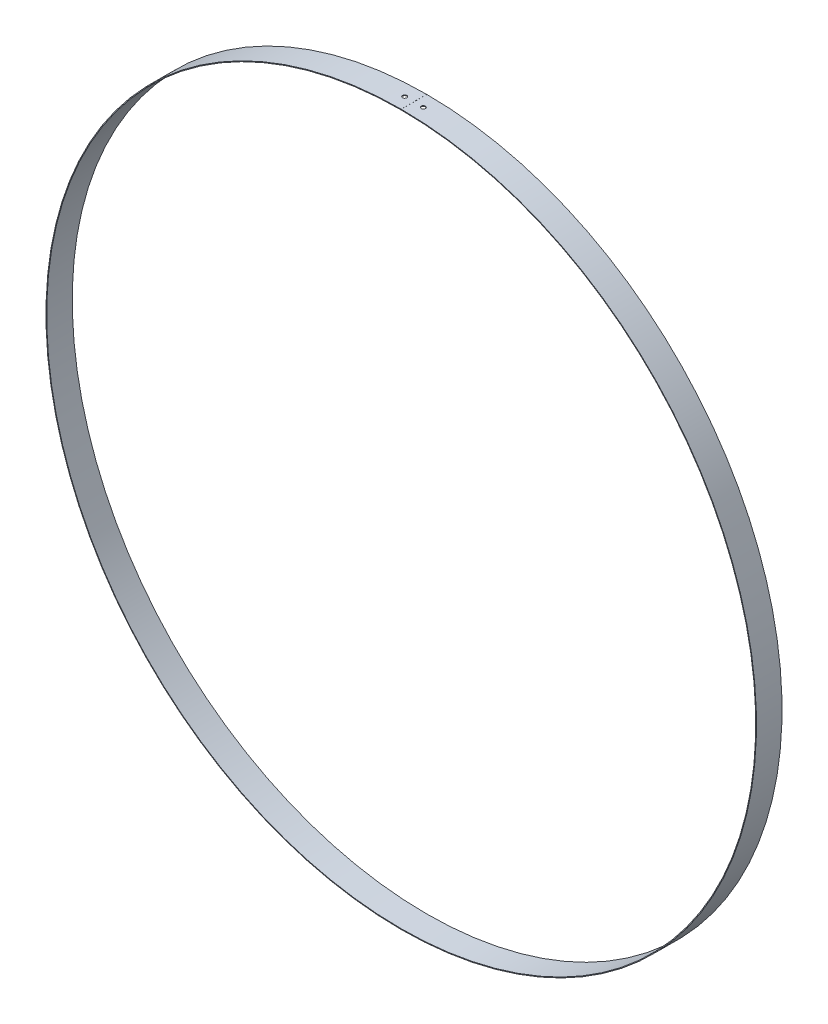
ISO-10303-21;
HEADER;
FILE_DESCRIPTION(('STEP AP214'),'2;1');
FILE_NAME('part.step','',(''),(''),'','','');
FILE_SCHEMA(('AUTOMOTIVE_DESIGN { 1 0 10303 214 1 1 1 1 }'));
ENDSEC;
DATA;
#1=APPLICATION_CONTEXT('core data for automotive mechanical design processes');
#2=APPLICATION_PROTOCOL_DEFINITION('international standard','automotive_design',2000,#1);
#3=PRODUCT_CONTEXT('',#1,'mechanical');
#4=PRODUCT('Part','Part','',(#3));
#5=PRODUCT_RELATED_PRODUCT_CATEGORY('part','',(#4));
#6=PRODUCT_DEFINITION_FORMATION('','',#4);
#7=PRODUCT_DEFINITION_CONTEXT('part definition',#1,'design');
#8=PRODUCT_DEFINITION('design','',#6,#7);
#9=PRODUCT_DEFINITION_SHAPE('','',#8);
#10=(LENGTH_UNIT() NAMED_UNIT(*) SI_UNIT(.MILLI.,.METRE.));
#11=(NAMED_UNIT(*) PLANE_ANGLE_UNIT() SI_UNIT($,.RADIAN.));
#12=(NAMED_UNIT(*) SI_UNIT($,.STERADIAN.) SOLID_ANGLE_UNIT());
#13=UNCERTAINTY_MEASURE_WITH_UNIT(LENGTH_MEASURE(1.E-05),#10,'distance_accuracy_value','');
#14=(GEOMETRIC_REPRESENTATION_CONTEXT(3) GLOBAL_UNCERTAINTY_ASSIGNED_CONTEXT((#13)) GLOBAL_UNIT_ASSIGNED_CONTEXT((#10,
#11,#12)) REPRESENTATION_CONTEXT('',''));
#15=CARTESIAN_POINT('',(0.,0.,0.));
#16=DIRECTION('',(0.,0.,1.));
#17=DIRECTION('',(1.,0.,0.));
#18=AXIS2_PLACEMENT_3D('',#15,#16,#17);
#19=CARTESIAN_POINT('',(0.0250250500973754,249.74999874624,8.99999999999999));
#20=DIRECTION('',(-0.99999999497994,0.000100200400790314,0.));
#21=DIRECTION('',(0.,0.,1.));
#22=AXIS2_PLACEMENT_3D('',#19,#20,#21);
#23=PLANE('',#22);
#24=DIRECTION('',(0.000100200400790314,0.99999999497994,0.));
#25=VECTOR('',#24,1.);
#26=CARTESIAN_POINT('',(0.0250250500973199,249.74999874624,0.));
#27=LINE('',#26,#25);
#28=CARTESIAN_POINT('',(0.0249999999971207,249.499998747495,0.));
#29=VERTEX_POINT('',#28);
#30=CARTESIAN_POINT('',(0.0250501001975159,249.999998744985,0.));
#31=VERTEX_POINT('',#30);
#32=EDGE_CURVE('E14',#29,#31,#27,.T.);
#33=ORIENTED_EDGE('',*,*,#32,.F.);
#34=DIRECTION('',(0.,0.,-1.));
#35=VECTOR('',#34,1.);
#36=CARTESIAN_POINT('',(0.0250000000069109,249.499998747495,1587.27889575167));
#37=LINE('',#36,#35);
#38=CARTESIAN_POINT('',(0.0249999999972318,249.499998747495,18.));
#39=VERTEX_POINT('',#38);
#40=EDGE_CURVE('E115',#29,#39,#37,.F.);
#41=ORIENTED_EDGE('',*,*,#40,.T.);
#42=DIRECTION('',(0.000100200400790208,0.99999999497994,0.));
#43=VECTOR('',#42,1.);
#44=CARTESIAN_POINT('',(0.0250250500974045,249.74999874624,18.));
#45=LINE('',#44,#43);
#46=CARTESIAN_POINT('',(0.0250501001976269,249.999998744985,18.));
#47=VERTEX_POINT('',#46);
#48=EDGE_CURVE('E66',#39,#47,#45,.T.);
#49=ORIENTED_EDGE('',*,*,#48,.T.);
#50=DIRECTION('',(0.,0.,-1.));
#51=VECTOR('',#50,1.);
#52=CARTESIAN_POINT('',(0.0250501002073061,249.999998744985,1587.27889575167));
#53=LINE('',#52,#51);
#54=EDGE_CURVE('E179',#31,#47,#53,.F.);
#55=ORIENTED_EDGE('',*,*,#54,.F.);
#56=EDGE_LOOP('',(#33,#41,#49,#55));
#57=FACE_BOUND('',#56,.T.);
#58=ADVANCED_FACE('F53',(#57),#23,.T.);
#59=CARTESIAN_POINT('',(0.,0.,18.));
#60=DIRECTION('',(0.,0.,-1.));
#61=DIRECTION('',(-1.,0.,0.));
#62=AXIS2_PLACEMENT_3D('',#59,#60,#61);
#63=PLANE('',#62);
#64=ORIENTED_EDGE('',*,*,#48,.F.);
#65=CARTESIAN_POINT('',(0.,0.,18.));
#66=DIRECTION('',(0.,0.,-1.));
#67=DIRECTION('',(-1.,0.,0.));
#68=AXIS2_PLACEMENT_3D('',#65,#66,#67);
#69=CIRCLE('',#68,249.5);
#70=CARTESIAN_POINT('',(-0.0249999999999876,249.499998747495,18.));
#71=VERTEX_POINT('',#70);
#72=EDGE_CURVE('E110',#71,#39,#69,.F.);
#73=ORIENTED_EDGE('',*,*,#72,.F.);
#74=DIRECTION('',(-0.000100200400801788,0.99999999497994,0.));
#75=VECTOR('',#74,1.);
#76=CARTESIAN_POINT('',(-0.0250250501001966,249.74999874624,18.));
#77=LINE('',#76,#75);
#78=CARTESIAN_POINT('',(-0.0250501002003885,249.999998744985,18.));
#79=VERTEX_POINT('',#78);
#80=EDGE_CURVE('E92',#71,#79,#77,.T.);
#81=ORIENTED_EDGE('',*,*,#80,.T.);
#82=CARTESIAN_POINT('',(0.,0.,18.));
#83=DIRECTION('',(0.,0.,-1.));
#84=DIRECTION('',(-1.,0.,0.));
#85=AXIS2_PLACEMENT_3D('',#82,#83,#84);
#86=CIRCLE('',#85,250.);
#87=EDGE_CURVE('E183',#79,#47,#86,.F.);
#88=ORIENTED_EDGE('',*,*,#87,.T.);
#89=EDGE_LOOP('',(#64,#73,#81,#88));
#90=FACE_BOUND('',#89,.T.);
#91=ADVANCED_FACE('F114',(#90),#63,.F.);
#92=CARTESIAN_POINT('',(-0.0250250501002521,249.74999874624,8.99999999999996));
#93=DIRECTION('',(0.99999999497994,0.000100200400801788,0.));
#94=DIRECTION('',(0.,0.,-1.));
#95=AXIS2_PLACEMENT_3D('',#92,#93,#94);
#96=PLANE('',#95);
#97=ORIENTED_EDGE('',*,*,#80,.F.);
#98=DIRECTION('',(0.,0.,-1.));
#99=VECTOR('',#98,1.);
#100=CARTESIAN_POINT('',(-0.0249999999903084,249.499998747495,1587.27889575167));
#101=LINE('',#100,#99);
#102=CARTESIAN_POINT('',(-0.0250000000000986,249.499998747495,0.));
#103=VERTEX_POINT('',#102);
#104=EDGE_CURVE('E96',#71,#103,#101,.T.);
#105=ORIENTED_EDGE('',*,*,#104,.T.);
#106=DIRECTION('',(-0.000100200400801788,0.99999999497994,0.));
#107=VECTOR('',#106,1.);
#108=CARTESIAN_POINT('',(-0.0250250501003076,249.74999874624,0.));
#109=LINE('',#108,#107);
#110=CARTESIAN_POINT('',(-0.0250501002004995,249.999998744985,0.));
#111=VERTEX_POINT('',#110);
#112=EDGE_CURVE('E60',#103,#111,#109,.T.);
#113=ORIENTED_EDGE('',*,*,#112,.T.);
#114=DIRECTION('',(0.,0.,-1.));
#115=VECTOR('',#114,1.);
#116=CARTESIAN_POINT('',(-0.0250501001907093,249.999998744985,1587.27889575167));
#117=LINE('',#116,#115);
#118=EDGE_CURVE('E99',#79,#111,#117,.T.);
#119=ORIENTED_EDGE('',*,*,#118,.F.);
#120=EDGE_LOOP('',(#97,#105,#113,#119));
#121=FACE_BOUND('',#120,.T.);
#122=ADVANCED_FACE('F94',(#121),#96,.T.);
#123=CARTESIAN_POINT('',(0.,0.,0.));
#124=DIRECTION('',(0.,0.,-1.));
#125=DIRECTION('',(-1.,0.,0.));
#126=AXIS2_PLACEMENT_3D('',#123,#124,#125);
#127=PLANE('',#126);
#128=CARTESIAN_POINT('',(0.,0.,0.));
#129=DIRECTION('',(0.,0.,-1.));
#130=DIRECTION('',(-1.,0.,0.));
#131=AXIS2_PLACEMENT_3D('',#128,#129,#130);
#132=CIRCLE('',#131,249.5);
#133=EDGE_CURVE('E112',#103,#29,#132,.F.);
#134=ORIENTED_EDGE('',*,*,#133,.T.);
#135=ORIENTED_EDGE('',*,*,#32,.T.);
#136=CARTESIAN_POINT('',(0.,0.,0.));
#137=DIRECTION('',(0.,0.,-1.));
#138=DIRECTION('',(-1.,0.,0.));
#139=AXIS2_PLACEMENT_3D('',#136,#137,#138);
#140=CIRCLE('',#139,250.);
#141=EDGE_CURVE('E184',#111,#31,#140,.F.);
#142=ORIENTED_EDGE('',*,*,#141,.F.);
#143=ORIENTED_EDGE('',*,*,#112,.F.);
#144=EDGE_LOOP('',(#134,#135,#142,#143));
#145=FACE_BOUND('',#144,.T.);
#146=ADVANCED_FACE('F136',(#145),#127,.T.);
#147=CARTESIAN_POINT('',(-8.04660977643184,249.870470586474,8.99999999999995));
#148=CARTESIAN_POINT('',(-8.0465376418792,249.870472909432,9.19907453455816));
#149=CARTESIAN_POINT('',(-8.00834239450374,249.871711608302,9.3906042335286));
#150=CARTESIAN_POINT('',(-7.85597282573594,249.876548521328,9.75792189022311));
#151=CARTESIAN_POINT('',(-7.74710979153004,249.879975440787,9.92039859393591));
#152=CARTESIAN_POINT('',(-7.46555661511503,249.888545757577,10.2014533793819));
#153=CARTESIAN_POINT('',(-7.30286583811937,249.893381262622,10.3098806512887));
#154=CARTESIAN_POINT('',(-6.93505681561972,249.903859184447,10.461952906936));
#155=CARTESIAN_POINT('',(-6.74329406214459,249.909118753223,10.4999806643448));
#156=CARTESIAN_POINT('',(-6.34518025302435,249.919543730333,10.5000193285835));
#157=CARTESIAN_POINT('',(-6.15346946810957,249.92432590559,10.4619404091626));
#158=CARTESIAN_POINT('',(-5.78552083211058,249.933114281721,10.3099071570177));
#159=CARTESIAN_POINT('',(-5.62288696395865,249.936797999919,10.2014329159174));
#160=CARTESIAN_POINT('',(-5.34115861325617,249.942977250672,9.92041914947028));
#161=CARTESIAN_POINT('',(-5.23237619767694,249.945250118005,9.75784801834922));
#162=CARTESIAN_POINT('',(-5.07986716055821,249.948396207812,9.39071187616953));
#163=CARTESIAN_POINT('',(-5.04170197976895,249.949157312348,9.19872485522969));
#164=CARTESIAN_POINT('',(-5.04155369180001,249.949160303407,8.80127515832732));
#165=CARTESIAN_POINT('',(-5.07990397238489,249.94839544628,8.60940191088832));
#166=CARTESIAN_POINT('',(-5.23232532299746,249.945251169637,8.24207201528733));
#167=CARTESIAN_POINT('',(-5.34120843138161,249.942976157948,8.0796053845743));
#168=CARTESIAN_POINT('',(-5.62283698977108,249.936799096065,7.79854273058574));
#169=CARTESIAN_POINT('',(-5.78554931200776,249.933113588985,7.69011898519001));
#170=CARTESIAN_POINT('',(-6.15340704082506,249.924327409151,7.5380474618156));
#171=CARTESIAN_POINT('',(-6.34518461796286,249.919543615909,7.50001970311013));
#172=CARTESIAN_POINT('',(-6.74328938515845,249.909118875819,7.499980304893));
#173=CARTESIAN_POINT('',(-6.93499697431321,249.903860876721,7.5380630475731));
#174=CARTESIAN_POINT('',(-7.30289188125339,249.89338053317,7.69008940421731));
#175=CARTESIAN_POINT('',(-7.46550057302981,249.888547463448,7.79856855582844));
#176=CARTESIAN_POINT('',(-7.74716576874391,249.879973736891,8.07957940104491));
#177=CARTESIAN_POINT('',(-7.85577186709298,249.876554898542,8.24179850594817));
#178=CARTESIAN_POINT('',(-8.00852936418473,249.871705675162,8.60964155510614));
#179=CARTESIAN_POINT('',(-8.04668191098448,249.870468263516,8.80092546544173));
#180=CARTESIAN_POINT('',(-8.04660977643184,249.870470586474,8.99999999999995));
#181=CARTESIAN_POINT('',(-8.03051655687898,249.370729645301,8.99999999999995));
#182=CARTESIAN_POINT('',(-8.03044456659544,249.370731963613,9.19907453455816));
#183=CARTESIAN_POINT('',(-7.99232570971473,249.371968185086,9.3906042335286));
#184=CARTESIAN_POINT('',(-7.84026088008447,249.376795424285,9.75792189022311));
#185=CARTESIAN_POINT('',(-7.73161557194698,249.380215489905,9.92039859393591));
#186=CARTESIAN_POINT('',(-7.4506255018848,249.388768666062,10.2014533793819));
#187=CARTESIAN_POINT('',(-7.28826010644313,249.393594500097,10.3098806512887));
#188=CARTESIAN_POINT('',(-6.92118670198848,249.404051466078,10.461952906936));
#189=CARTESIAN_POINT('',(-6.7298074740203,249.409300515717,10.4999806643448));
#190=CARTESIAN_POINT('',(-6.33248989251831,249.419704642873,10.5000193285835));
#191=CARTESIAN_POINT('',(-6.14116252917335,249.424477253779,10.4619404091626));
#192=CARTESIAN_POINT('',(-5.77394979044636,249.433248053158,10.3099071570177));
#193=CARTESIAN_POINT('',(-5.61164119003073,249.436924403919,10.2014329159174));
#194=CARTESIAN_POINT('',(-5.33047629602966,249.44309129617,9.92041914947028));
#195=CARTESIAN_POINT('',(-5.22191144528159,249.445359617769,9.75784801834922));
#196=CARTESIAN_POINT('',(-5.06970742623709,249.448499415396,9.39071187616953));
#197=CARTESIAN_POINT('',(-5.03161857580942,249.449258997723,9.19872485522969));
#198=CARTESIAN_POINT('',(-5.03147058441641,249.4492619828,8.80127515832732));
#199=CARTESIAN_POINT('',(-5.06974416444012,249.448498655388,8.60940191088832));
#200=CARTESIAN_POINT('',(-5.22186067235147,249.445360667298,8.24207201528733));
#201=CARTESIAN_POINT('',(-5.33052601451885,249.443090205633,8.0796053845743));
#202=CARTESIAN_POINT('',(-5.61159131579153,249.436925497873,7.79854273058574));
#203=CARTESIAN_POINT('',(-5.77397821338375,249.433247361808,7.69011898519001));
#204=CARTESIAN_POINT('',(-6.14110022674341,249.424478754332,7.5380474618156));
#205=CARTESIAN_POINT('',(-6.33249424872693,249.419704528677,7.50001970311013));
#206=CARTESIAN_POINT('',(-6.72980280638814,249.409300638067,7.499980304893));
#207=CARTESIAN_POINT('',(-6.92112698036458,249.404053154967,7.5380630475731));
#208=CARTESIAN_POINT('',(-7.28828609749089,249.393593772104,7.69008940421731));
#209=CARTESIAN_POINT('',(-7.45056957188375,249.388770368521,7.79856855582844));
#210=CARTESIAN_POINT('',(-7.73167143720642,249.380213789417,8.07957940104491));
#211=CARTESIAN_POINT('',(-7.8400603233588,249.376801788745,8.24179850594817));
#212=CARTESIAN_POINT('',(-7.99251230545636,249.371962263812,8.60964155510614));
#213=CARTESIAN_POINT('',(-8.03058854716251,249.370727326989,8.80092546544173));
#214=CARTESIAN_POINT('',(-8.03051655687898,249.370729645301,8.99999999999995));
#215=B_SPLINE_SURFACE_WITH_KNOTS('',1,3,((#147,#148,#149,#150,#151,#152,#153,#154,#155,#156,
#157,#158,#159,#160,#161,#162,#163,#164,#165,#166,#167,#168,#169,#170,#171,#172,#173,#174,#175,
#176,#177,#178,#179,#180),(#181,#182,#183,#184,#185,#186,#187,#188,#189,#190,#191,#192,#193,
#194,#195,#196,#197,#198,#199,#200,#201,#202,#203,#204,#205,#206,#207,#208,#209,#210,#211,#212,
#213,#214)),.UNSPECIFIED.,.F.,.T.,.F.,(2,2),(4,2,2,2,2,2,2,2,2,2,2,2,2,2,2,2,4),(0.,1.),(0.,
0.0625,0.125,0.1875,0.25,0.3125,0.375,0.4375,0.5,0.5625,0.625,0.6875,0.75,0.8125,0.875,0.9375,
1.),.UNSPECIFIED.);
#216=CARTESIAN_POINT('',(-8.04660977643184,249.870470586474,8.99999999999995));
#217=CARTESIAN_POINT('',(-8.0465376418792,249.870472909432,9.19907453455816));
#218=CARTESIAN_POINT('',(-8.00834239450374,249.871711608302,9.3906042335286));
#219=CARTESIAN_POINT('',(-7.85597282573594,249.876548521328,9.75792189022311));
#220=CARTESIAN_POINT('',(-7.74710979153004,249.879975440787,9.92039859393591));
#221=CARTESIAN_POINT('',(-7.46555661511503,249.888545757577,10.2014533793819));
#222=CARTESIAN_POINT('',(-7.30286583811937,249.893381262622,10.3098806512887));
#223=CARTESIAN_POINT('',(-6.93505681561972,249.903859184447,10.461952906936));
#224=CARTESIAN_POINT('',(-6.74329406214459,249.909118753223,10.4999806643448));
#225=CARTESIAN_POINT('',(-6.34518025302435,249.919543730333,10.5000193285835));
#226=CARTESIAN_POINT('',(-6.15346946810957,249.92432590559,10.4619404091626));
#227=CARTESIAN_POINT('',(-5.78552083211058,249.933114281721,10.3099071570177));
#228=CARTESIAN_POINT('',(-5.62288696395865,249.936797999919,10.2014329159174));
#229=CARTESIAN_POINT('',(-5.34115861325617,249.942977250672,9.92041914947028));
#230=CARTESIAN_POINT('',(-5.23237619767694,249.945250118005,9.75784801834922));
#231=CARTESIAN_POINT('',(-5.07986716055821,249.948396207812,9.39071187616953));
#232=CARTESIAN_POINT('',(-5.04170197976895,249.949157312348,9.19872485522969));
#233=CARTESIAN_POINT('',(-5.04155369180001,249.949160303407,8.80127515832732));
#234=CARTESIAN_POINT('',(-5.07990397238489,249.94839544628,8.60940191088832));
#235=CARTESIAN_POINT('',(-5.23232532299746,249.945251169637,8.24207201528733));
#236=CARTESIAN_POINT('',(-5.34120843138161,249.942976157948,8.0796053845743));
#237=CARTESIAN_POINT('',(-5.62283698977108,249.936799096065,7.79854273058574));
#238=CARTESIAN_POINT('',(-5.78554931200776,249.933113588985,7.69011898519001));
#239=CARTESIAN_POINT('',(-6.15340704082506,249.924327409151,7.5380474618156));
#240=CARTESIAN_POINT('',(-6.34518461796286,249.919543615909,7.50001970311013));
#241=CARTESIAN_POINT('',(-6.74328938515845,249.909118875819,7.499980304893));
#242=CARTESIAN_POINT('',(-6.93499697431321,249.903860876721,7.5380630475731));
#243=CARTESIAN_POINT('',(-7.30289188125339,249.89338053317,7.69008940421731));
#244=CARTESIAN_POINT('',(-7.46550057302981,249.888547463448,7.79856855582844));
#245=CARTESIAN_POINT('',(-7.74716576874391,249.879973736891,8.07957940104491));
#246=CARTESIAN_POINT('',(-7.85577186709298,249.876554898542,8.24179850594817));
#247=CARTESIAN_POINT('',(-8.00852936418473,249.871705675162,8.60964155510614));
#248=CARTESIAN_POINT('',(-8.04668191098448,249.870468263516,8.80092546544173));
#249=CARTESIAN_POINT('',(-8.04660977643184,249.870470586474,8.99999999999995));
#250=B_SPLINE_CURVE_WITH_KNOTS('',3,(#216,#217,#218,#219,#220,#221,#222,#223,#224,#225,#226,
#227,#228,#229,#230,#231,#232,#233,#234,#235,#236,#237,#238,#239,#240,#241,#242,#243,#244,#245,
#246,#247,#248,#249),.UNSPECIFIED.,.T.,.F.,(4,2,2,2,2,2,2,2,2,2,2,2,2,2,2,2,4),(0.,0.0625,0.125,
0.1875,0.25,0.3125,0.375,0.4375,0.5,0.5625,0.625,0.6875,0.75,0.8125,0.875,0.9375,1.),.UNSPECIFIED.);
#251=CARTESIAN_POINT('',(-8.04660977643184,249.870470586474,8.99999999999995));
#252=VERTEX_POINT('',#251);
#253=EDGE_CURVE('E188',#252,#252,#250,.T.);
#254=CARTESIAN_POINT('',(-8.03051655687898,249.370729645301,8.99999999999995));
#255=CARTESIAN_POINT('',(-8.03058854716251,249.370727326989,8.80092546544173));
#256=CARTESIAN_POINT('',(-7.99251230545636,249.371962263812,8.60964155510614));
#257=CARTESIAN_POINT('',(-7.8400603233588,249.376801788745,8.24179850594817));
#258=CARTESIAN_POINT('',(-7.73167143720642,249.380213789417,8.07957940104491));
#259=CARTESIAN_POINT('',(-7.45056957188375,249.388770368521,7.79856855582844));
#260=CARTESIAN_POINT('',(-7.28828609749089,249.393593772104,7.69008940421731));
#261=CARTESIAN_POINT('',(-6.92112698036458,249.404053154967,7.5380630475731));
#262=CARTESIAN_POINT('',(-6.72980280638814,249.409300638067,7.499980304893));
#263=CARTESIAN_POINT('',(-6.33249424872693,249.419704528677,7.50001970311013));
#264=CARTESIAN_POINT('',(-6.14110022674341,249.424478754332,7.5380474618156));
#265=CARTESIAN_POINT('',(-5.77397821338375,249.433247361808,7.69011898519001));
#266=CARTESIAN_POINT('',(-5.61159131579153,249.436925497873,7.79854273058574));
#267=CARTESIAN_POINT('',(-5.33052601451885,249.443090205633,8.0796053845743));
#268=CARTESIAN_POINT('',(-5.22186067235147,249.445360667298,8.24207201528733));
#269=CARTESIAN_POINT('',(-5.06974416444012,249.448498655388,8.60940191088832));
#270=CARTESIAN_POINT('',(-5.03147058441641,249.4492619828,8.80127515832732));
#271=CARTESIAN_POINT('',(-5.03161857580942,249.449258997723,9.19872485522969));
#272=CARTESIAN_POINT('',(-5.06970742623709,249.448499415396,9.39071187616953));
#273=CARTESIAN_POINT('',(-5.22191144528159,249.445359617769,9.75784801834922));
#274=CARTESIAN_POINT('',(-5.33047629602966,249.44309129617,9.92041914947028));
#275=CARTESIAN_POINT('',(-5.61164119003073,249.436924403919,10.2014329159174));
#276=CARTESIAN_POINT('',(-5.77394979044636,249.433248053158,10.3099071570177));
#277=CARTESIAN_POINT('',(-6.14116252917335,249.424477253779,10.4619404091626));
#278=CARTESIAN_POINT('',(-6.33248989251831,249.419704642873,10.5000193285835));
#279=CARTESIAN_POINT('',(-6.7298074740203,249.409300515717,10.4999806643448));
#280=CARTESIAN_POINT('',(-6.92118670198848,249.404051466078,10.461952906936));
#281=CARTESIAN_POINT('',(-7.28826010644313,249.393594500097,10.3098806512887));
#282=CARTESIAN_POINT('',(-7.4506255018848,249.388768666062,10.2014533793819));
#283=CARTESIAN_POINT('',(-7.73161557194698,249.380215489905,9.92039859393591));
#284=CARTESIAN_POINT('',(-7.84026088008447,249.376795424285,9.75792189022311));
#285=CARTESIAN_POINT('',(-7.99232570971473,249.371968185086,9.3906042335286));
#286=CARTESIAN_POINT('',(-8.03044456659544,249.370731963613,9.19907453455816));
#287=CARTESIAN_POINT('',(-8.03051655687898,249.370729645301,8.99999999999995));
#288=B_SPLINE_CURVE_WITH_KNOTS('',3,(#254,#255,#256,#257,#258,#259,#260,#261,#262,#263,#264,
#265,#266,#267,#268,#269,#270,#271,#272,#273,#274,#275,#276,#277,#278,#279,#280,#281,#282,#283,
#284,#285,#286,#287),.UNSPECIFIED.,.T.,.F.,(4,2,2,2,2,2,2,2,2,2,2,2,2,2,2,2,4),(0.,0.0625,0.125,
0.1875,0.25,0.3125,0.375,0.4375,0.5,0.5625,0.625,0.6875,0.75,0.8125,0.875,0.9375,1.),.UNSPECIFIED.);
#289=CARTESIAN_POINT('',(-8.03051655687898,249.370729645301,8.99999999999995));
#290=VERTEX_POINT('',#289);
#291=EDGE_CURVE('E120',#290,#290,#288,.F.);
#292=ORIENTED_EDGE('',*,*,#253,.T.);
#293=EDGE_LOOP('',(#292));
#294=FACE_BOUND('',#293,.T.);
#295=ORIENTED_EDGE('',*,*,#291,.F.);
#296=EDGE_LOOP('',(#295));
#297=FACE_BOUND('',#296,.T.);
#298=ADVANCED_FACE('F206',(#294,#297),#215,.F.);
#299=CARTESIAN_POINT('',(8.04660977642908,249.870470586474,8.99999999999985));
#300=CARTESIAN_POINT('',(8.04653764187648,249.870472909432,9.1990745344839));
#301=CARTESIAN_POINT('',(8.00834239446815,249.871711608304,9.39060423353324));
#302=CARTESIAN_POINT('',(7.85597282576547,249.876548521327,9.75792189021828));
#303=CARTESIAN_POINT('',(7.74710979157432,249.879975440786,9.92039859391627));
#304=CARTESIAN_POINT('',(7.46555661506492,249.888545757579,10.2014533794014));
#305=CARTESIAN_POINT('',(7.30286583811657,249.893381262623,10.3098806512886));
#306=CARTESIAN_POINT('',(6.93505681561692,249.903859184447,10.4619529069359));
#307=CARTESIAN_POINT('',(6.74329406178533,249.909118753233,10.4999806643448));
#308=CARTESIAN_POINT('',(6.34518025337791,249.919543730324,10.5000193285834));
#309=CARTESIAN_POINT('',(6.15346946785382,249.924325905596,10.4619404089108));
#310=CARTESIAN_POINT('',(5.78552083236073,249.933114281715,10.3099071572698));
#311=CARTESIAN_POINT('',(5.62288696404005,249.936797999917,10.2014329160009));
#312=CARTESIAN_POINT('',(5.3411586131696,249.942977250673,9.92041914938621));
#313=CARTESIAN_POINT('',(5.23237619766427,249.945250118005,9.75784801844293));
#314=CARTESIAN_POINT('',(5.07986716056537,249.948396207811,9.39071187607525));
#315=CARTESIAN_POINT('',(5.04170197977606,249.949157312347,9.19872485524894));
#316=CARTESIAN_POINT('',(5.04155369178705,249.949160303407,8.8012751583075));
#317=CARTESIAN_POINT('',(5.07990397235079,249.948395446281,8.60940191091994));
#318=CARTESIAN_POINT('',(5.23232532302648,249.945251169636,8.24207201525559));
#319=CARTESIAN_POINT('',(5.34120843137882,249.942976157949,8.07960538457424));
#320=CARTESIAN_POINT('',(5.62283698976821,249.936799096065,7.79854273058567));
#321=CARTESIAN_POINT('',(5.78554931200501,249.933113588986,7.69011898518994));
#322=CARTESIAN_POINT('',(6.15340704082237,249.924327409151,7.53804746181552));
#323=CARTESIAN_POINT('',(6.34518461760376,249.919543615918,7.50001970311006));
#324=CARTESIAN_POINT('',(6.7432893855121,249.90911887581,7.49998030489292));
#325=CARTESIAN_POINT('',(6.93499697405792,249.903860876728,7.53806304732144));
#326=CARTESIAN_POINT('',(7.30289188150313,249.893380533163,7.69008940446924));
#327=CARTESIAN_POINT('',(7.46550057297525,249.88854746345,7.79856855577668));
#328=CARTESIAN_POINT('',(7.74716576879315,249.87997373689,8.07957940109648));
#329=CARTESIAN_POINT('',(7.85577186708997,249.876554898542,8.24179850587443));
#330=CARTESIAN_POINT('',(8.00852936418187,249.871705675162,8.60964155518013));
#331=CARTESIAN_POINT('',(8.04668191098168,249.870468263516,8.80092546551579));
#332=CARTESIAN_POINT('',(8.04660977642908,249.870470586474,8.99999999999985));
#333=CARTESIAN_POINT('',(8.03051655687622,249.370729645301,8.99999999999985));
#334=CARTESIAN_POINT('',(8.03044456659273,249.370731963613,9.1990745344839));
#335=CARTESIAN_POINT('',(7.99232570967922,249.371968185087,9.39060423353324));
#336=CARTESIAN_POINT('',(7.84026088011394,249.376795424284,9.75792189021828));
#337=CARTESIAN_POINT('',(7.73161557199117,249.380215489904,9.92039859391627));
#338=CARTESIAN_POINT('',(7.45062550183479,249.388768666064,10.2014533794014));
#339=CARTESIAN_POINT('',(7.28826010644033,249.393594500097,10.3098806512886));
#340=CARTESIAN_POINT('',(6.92118670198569,249.404051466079,10.4619529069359));
#341=CARTESIAN_POINT('',(6.72980747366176,249.409300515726,10.4999806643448));
#342=CARTESIAN_POINT('',(6.33248989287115,249.419704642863,10.5000193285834));
#343=CARTESIAN_POINT('',(6.14116252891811,249.424477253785,10.4619404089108));
#344=CARTESIAN_POINT('',(5.77394979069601,249.433248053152,10.3099071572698));
#345=CARTESIAN_POINT('',(5.61164119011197,249.436924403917,10.2014329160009));
#346=CARTESIAN_POINT('',(5.33047629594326,249.443091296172,9.92041914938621));
#347=CARTESIAN_POINT('',(5.22191144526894,249.445359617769,9.75784801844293));
#348=CARTESIAN_POINT('',(5.06970742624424,249.448499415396,9.39071187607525));
#349=CARTESIAN_POINT('',(5.0316185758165,249.449258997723,9.19872485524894));
#350=CARTESIAN_POINT('',(5.03147058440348,249.4492619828,8.8012751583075));
#351=CARTESIAN_POINT('',(5.06974416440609,249.448498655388,8.60940191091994));
#352=CARTESIAN_POINT('',(5.22186067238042,249.445360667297,8.24207201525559));
#353=CARTESIAN_POINT('',(5.33052601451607,249.443090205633,8.07960538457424));
#354=CARTESIAN_POINT('',(5.61159131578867,249.436925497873,7.79854273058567));
#355=CARTESIAN_POINT('',(5.773978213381,249.433247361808,7.69011898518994));
#356=CARTESIAN_POINT('',(6.14110022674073,249.424478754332,7.53804746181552));
#357=CARTESIAN_POINT('',(6.33249424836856,249.419704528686,7.50001970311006));
#358=CARTESIAN_POINT('',(6.72980280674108,249.409300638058,7.49998030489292));
#359=CARTESIAN_POINT('',(6.9211269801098,249.404053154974,7.53806304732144));
#360=CARTESIAN_POINT('',(7.28828609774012,249.393593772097,7.69008940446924));
#361=CARTESIAN_POINT('',(7.4505695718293,249.388770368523,7.79856855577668));
#362=CARTESIAN_POINT('',(7.73167143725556,249.380213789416,8.07957940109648));
#363=CARTESIAN_POINT('',(7.84006032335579,249.376801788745,8.24179850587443));
#364=CARTESIAN_POINT('',(7.99251230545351,249.371962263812,8.60964155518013));
#365=CARTESIAN_POINT('',(8.03058854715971,249.370727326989,8.80092546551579));
#366=CARTESIAN_POINT('',(8.03051655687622,249.370729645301,8.99999999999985));
#367=B_SPLINE_SURFACE_WITH_KNOTS('',1,3,((#299,#300,#301,#302,#303,#304,#305,#306,#307,#308,
#309,#310,#311,#312,#313,#314,#315,#316,#317,#318,#319,#320,#321,#322,#323,#324,#325,#326,#327,
#328,#329,#330,#331,#332),(#333,#334,#335,#336,#337,#338,#339,#340,#341,#342,#343,#344,#345,
#346,#347,#348,#349,#350,#351,#352,#353,#354,#355,#356,#357,#358,#359,#360,#361,#362,#363,#364,
#365,#366)),.UNSPECIFIED.,.F.,.T.,.F.,(2,2),(4,2,2,2,2,2,2,2,2,2,2,2,2,2,2,2,4),(0.,1.),(0.,
0.0625,0.125,0.1875,0.25,0.3125,0.375,0.4375,0.5,0.5625,0.625,0.6875,0.75,0.8125,0.875,0.9375,
1.),.UNSPECIFIED.);
#368=CARTESIAN_POINT('',(8.04660977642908,249.870470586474,8.99999999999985));
#369=CARTESIAN_POINT('',(8.04668191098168,249.870468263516,8.80092546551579));
#370=CARTESIAN_POINT('',(8.00852936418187,249.871705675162,8.60964155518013));
#371=CARTESIAN_POINT('',(7.85577186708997,249.876554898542,8.24179850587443));
#372=CARTESIAN_POINT('',(7.74716576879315,249.87997373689,8.07957940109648));
#373=CARTESIAN_POINT('',(7.46550057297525,249.88854746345,7.79856855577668));
#374=CARTESIAN_POINT('',(7.30289188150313,249.893380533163,7.69008940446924));
#375=CARTESIAN_POINT('',(6.93499697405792,249.903860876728,7.53806304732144));
#376=CARTESIAN_POINT('',(6.7432893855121,249.90911887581,7.49998030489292));
#377=CARTESIAN_POINT('',(6.34518461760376,249.919543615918,7.50001970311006));
#378=CARTESIAN_POINT('',(6.15340704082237,249.924327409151,7.53804746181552));
#379=CARTESIAN_POINT('',(5.78554931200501,249.933113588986,7.69011898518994));
#380=CARTESIAN_POINT('',(5.62283698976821,249.936799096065,7.79854273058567));
#381=CARTESIAN_POINT('',(5.34120843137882,249.942976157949,8.07960538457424));
#382=CARTESIAN_POINT('',(5.23232532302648,249.945251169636,8.24207201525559));
#383=CARTESIAN_POINT('',(5.07990397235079,249.948395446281,8.60940191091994));
#384=CARTESIAN_POINT('',(5.04155369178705,249.949160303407,8.8012751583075));
#385=CARTESIAN_POINT('',(5.04170197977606,249.949157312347,9.19872485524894));
#386=CARTESIAN_POINT('',(5.07986716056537,249.948396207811,9.39071187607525));
#387=CARTESIAN_POINT('',(5.23237619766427,249.945250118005,9.75784801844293));
#388=CARTESIAN_POINT('',(5.3411586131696,249.942977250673,9.92041914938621));
#389=CARTESIAN_POINT('',(5.62288696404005,249.936797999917,10.2014329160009));
#390=CARTESIAN_POINT('',(5.78552083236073,249.933114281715,10.3099071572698));
#391=CARTESIAN_POINT('',(6.15346946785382,249.924325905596,10.4619404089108));
#392=CARTESIAN_POINT('',(6.34518025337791,249.919543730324,10.5000193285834));
#393=CARTESIAN_POINT('',(6.74329406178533,249.909118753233,10.4999806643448));
#394=CARTESIAN_POINT('',(6.93505681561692,249.903859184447,10.4619529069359));
#395=CARTESIAN_POINT('',(7.30286583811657,249.893381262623,10.3098806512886));
#396=CARTESIAN_POINT('',(7.46555661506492,249.888545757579,10.2014533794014));
#397=CARTESIAN_POINT('',(7.74710979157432,249.879975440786,9.92039859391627));
#398=CARTESIAN_POINT('',(7.85597282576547,249.876548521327,9.75792189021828));
#399=CARTESIAN_POINT('',(8.00834239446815,249.871711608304,9.39060423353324));
#400=CARTESIAN_POINT('',(8.04653764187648,249.870472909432,9.1990745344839));
#401=CARTESIAN_POINT('',(8.04660977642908,249.870470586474,8.99999999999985));
#402=B_SPLINE_CURVE_WITH_KNOTS('',3,(#368,#369,#370,#371,#372,#373,#374,#375,#376,#377,#378,
#379,#380,#381,#382,#383,#384,#385,#386,#387,#388,#389,#390,#391,#392,#393,#394,#395,#396,#397,
#398,#399,#400,#401),.UNSPECIFIED.,.T.,.F.,(4,2,2,2,2,2,2,2,2,2,2,2,2,2,2,2,4),(0.,0.0625,0.125,
0.1875,0.25,0.3125,0.375,0.4375,0.5,0.5625,0.625,0.6875,0.75,0.8125,0.875,0.9375,1.),.UNSPECIFIED.);
#403=CARTESIAN_POINT('',(8.04660977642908,249.870470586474,8.99999999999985));
#404=VERTEX_POINT('',#403);
#405=EDGE_CURVE('E156',#404,#404,#402,.F.);
#406=CARTESIAN_POINT('',(8.03051655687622,249.370729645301,8.99999999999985));
#407=CARTESIAN_POINT('',(8.03044456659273,249.370731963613,9.1990745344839));
#408=CARTESIAN_POINT('',(7.99232570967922,249.371968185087,9.39060423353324));
#409=CARTESIAN_POINT('',(7.84026088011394,249.376795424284,9.75792189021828));
#410=CARTESIAN_POINT('',(7.73161557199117,249.380215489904,9.92039859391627));
#411=CARTESIAN_POINT('',(7.45062550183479,249.388768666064,10.2014533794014));
#412=CARTESIAN_POINT('',(7.28826010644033,249.393594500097,10.3098806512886));
#413=CARTESIAN_POINT('',(6.92118670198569,249.404051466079,10.4619529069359));
#414=CARTESIAN_POINT('',(6.72980747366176,249.409300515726,10.4999806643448));
#415=CARTESIAN_POINT('',(6.33248989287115,249.419704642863,10.5000193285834));
#416=CARTESIAN_POINT('',(6.14116252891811,249.424477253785,10.4619404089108));
#417=CARTESIAN_POINT('',(5.77394979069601,249.433248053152,10.3099071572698));
#418=CARTESIAN_POINT('',(5.61164119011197,249.436924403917,10.2014329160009));
#419=CARTESIAN_POINT('',(5.33047629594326,249.443091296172,9.92041914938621));
#420=CARTESIAN_POINT('',(5.22191144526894,249.445359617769,9.75784801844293));
#421=CARTESIAN_POINT('',(5.06970742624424,249.448499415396,9.39071187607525));
#422=CARTESIAN_POINT('',(5.0316185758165,249.449258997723,9.19872485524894));
#423=CARTESIAN_POINT('',(5.03147058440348,249.4492619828,8.8012751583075));
#424=CARTESIAN_POINT('',(5.06974416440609,249.448498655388,8.60940191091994));
#425=CARTESIAN_POINT('',(5.22186067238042,249.445360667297,8.24207201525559));
#426=CARTESIAN_POINT('',(5.33052601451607,249.443090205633,8.07960538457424));
#427=CARTESIAN_POINT('',(5.61159131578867,249.436925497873,7.79854273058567));
#428=CARTESIAN_POINT('',(5.773978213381,249.433247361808,7.69011898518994));
#429=CARTESIAN_POINT('',(6.14110022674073,249.424478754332,7.53804746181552));
#430=CARTESIAN_POINT('',(6.33249424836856,249.419704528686,7.50001970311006));
#431=CARTESIAN_POINT('',(6.72980280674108,249.409300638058,7.49998030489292));
#432=CARTESIAN_POINT('',(6.9211269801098,249.404053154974,7.53806304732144));
#433=CARTESIAN_POINT('',(7.28828609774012,249.393593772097,7.69008940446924));
#434=CARTESIAN_POINT('',(7.4505695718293,249.388770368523,7.79856855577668));
#435=CARTESIAN_POINT('',(7.73167143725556,249.380213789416,8.07957940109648));
#436=CARTESIAN_POINT('',(7.84006032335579,249.376801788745,8.24179850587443));
#437=CARTESIAN_POINT('',(7.99251230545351,249.371962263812,8.60964155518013));
#438=CARTESIAN_POINT('',(8.03058854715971,249.370727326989,8.80092546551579));
#439=CARTESIAN_POINT('',(8.03051655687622,249.370729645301,8.99999999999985));
#440=B_SPLINE_CURVE_WITH_KNOTS('',3,(#406,#407,#408,#409,#410,#411,#412,#413,#414,#415,#416,
#417,#418,#419,#420,#421,#422,#423,#424,#425,#426,#427,#428,#429,#430,#431,#432,#433,#434,#435,
#436,#437,#438,#439),.UNSPECIFIED.,.T.,.F.,(4,2,2,2,2,2,2,2,2,2,2,2,2,2,2,2,4),(0.,0.0625,0.125,
0.1875,0.25,0.3125,0.375,0.4375,0.5,0.5625,0.625,0.6875,0.75,0.8125,0.875,0.9375,1.),.UNSPECIFIED.);
#441=CARTESIAN_POINT('',(8.03051655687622,249.370729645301,8.99999999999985));
#442=VERTEX_POINT('',#441);
#443=EDGE_CURVE('E168',#442,#442,#440,.T.);
#444=ORIENTED_EDGE('',*,*,#405,.F.);
#445=EDGE_LOOP('',(#444));
#446=FACE_BOUND('',#445,.T.);
#447=ORIENTED_EDGE('',*,*,#443,.T.);
#448=EDGE_LOOP('',(#447));
#449=FACE_BOUND('',#448,.T.);
#450=ADVANCED_FACE('F55',(#446,#449),#367,.T.);
#451=CARTESIAN_POINT('',(9.72924082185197E-12,0.,1587.27889575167));
#452=DIRECTION('',(0.,0.,-1.));
#453=DIRECTION('',(-1.,0.,0.));
#454=AXIS2_PLACEMENT_3D('',#451,#452,#453);
#455=CYLINDRICAL_SURFACE('',#454,250.);
#456=ORIENTED_EDGE('',*,*,#118,.T.);
#457=ORIENTED_EDGE('',*,*,#141,.T.);
#458=ORIENTED_EDGE('',*,*,#54,.T.);
#459=ORIENTED_EDGE('',*,*,#87,.F.);
#460=EDGE_LOOP('',(#456,#457,#458,#459));
#461=FACE_BOUND('',#460,.T.);
#462=ORIENTED_EDGE('',*,*,#253,.F.);
#463=EDGE_LOOP('',(#462));
#464=FACE_BOUND('',#463,.T.);
#465=ORIENTED_EDGE('',*,*,#405,.T.);
#466=EDGE_LOOP('',(#465));
#467=FACE_BOUND('',#466,.T.);
#468=ADVANCED_FACE('F135',(#461,#464,#467),#455,.T.);
#469=CARTESIAN_POINT('',(9.72924082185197E-12,0.,1587.27889575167));
#470=DIRECTION('',(0.,0.,-1.));
#471=DIRECTION('',(-1.,0.,0.));
#472=AXIS2_PLACEMENT_3D('',#469,#470,#471);
#473=CYLINDRICAL_SURFACE('',#472,249.5);
#474=ORIENTED_EDGE('',*,*,#104,.F.);
#475=ORIENTED_EDGE('',*,*,#72,.T.);
#476=ORIENTED_EDGE('',*,*,#40,.F.);
#477=ORIENTED_EDGE('',*,*,#133,.F.);
#478=EDGE_LOOP('',(#474,#475,#476,#477));
#479=FACE_BOUND('',#478,.T.);
#480=ORIENTED_EDGE('',*,*,#291,.T.);
#481=EDGE_LOOP('',(#480));
#482=FACE_BOUND('',#481,.T.);
#483=ORIENTED_EDGE('',*,*,#443,.F.);
#484=EDGE_LOOP('',(#483));
#485=FACE_BOUND('',#484,.T.);
#486=ADVANCED_FACE('F107',(#479,#482,#485),#473,.F.);
#487=CLOSED_SHELL('',(#58,#91,#122,#146,#298,#450,#468,#486));
#488=MANIFOLD_SOLID_BREP('B2',#487);
#489=ADVANCED_BREP_SHAPE_REPRESENTATION('',(#18,#488),#14);
#490=SHAPE_DEFINITION_REPRESENTATION(#9,#489);
ENDSEC;
END-ISO-10303-21;
